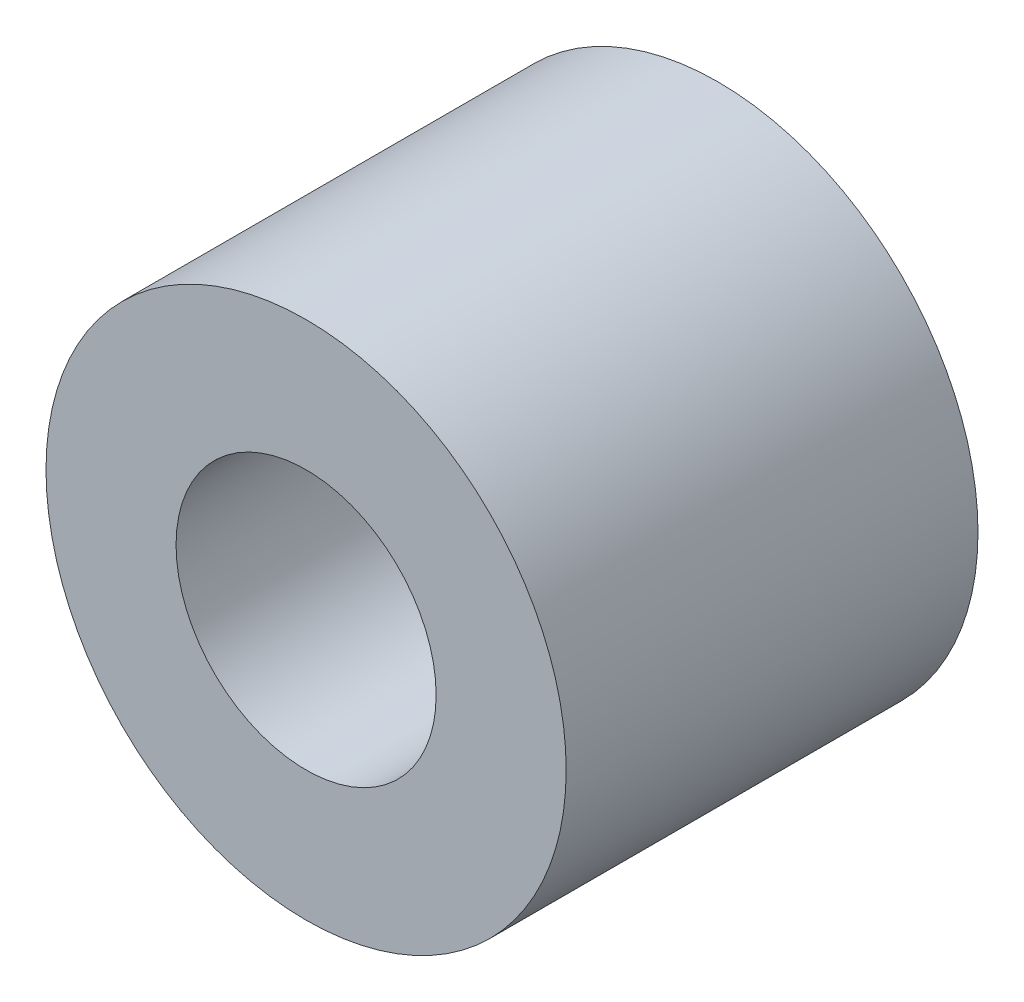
from build123d import *

# Parameters (mm, degrees)
SKETCH1_R           = 6
SKETCH1_R_2         = 3
BOSS_EXTRUDE1_DEPTH = 9.5


with BuildPart() as part:
    # Sketch1 → Boss-Extrude1 (new body)
    with BuildSketch(Plane.XY):
        Circle(SKETCH1_R)
        Circle(SKETCH1_R_2, mode=Mode.SUBTRACT)
    extrude(amount=BOSS_EXTRUDE1_DEPTH)


solid = part.part
